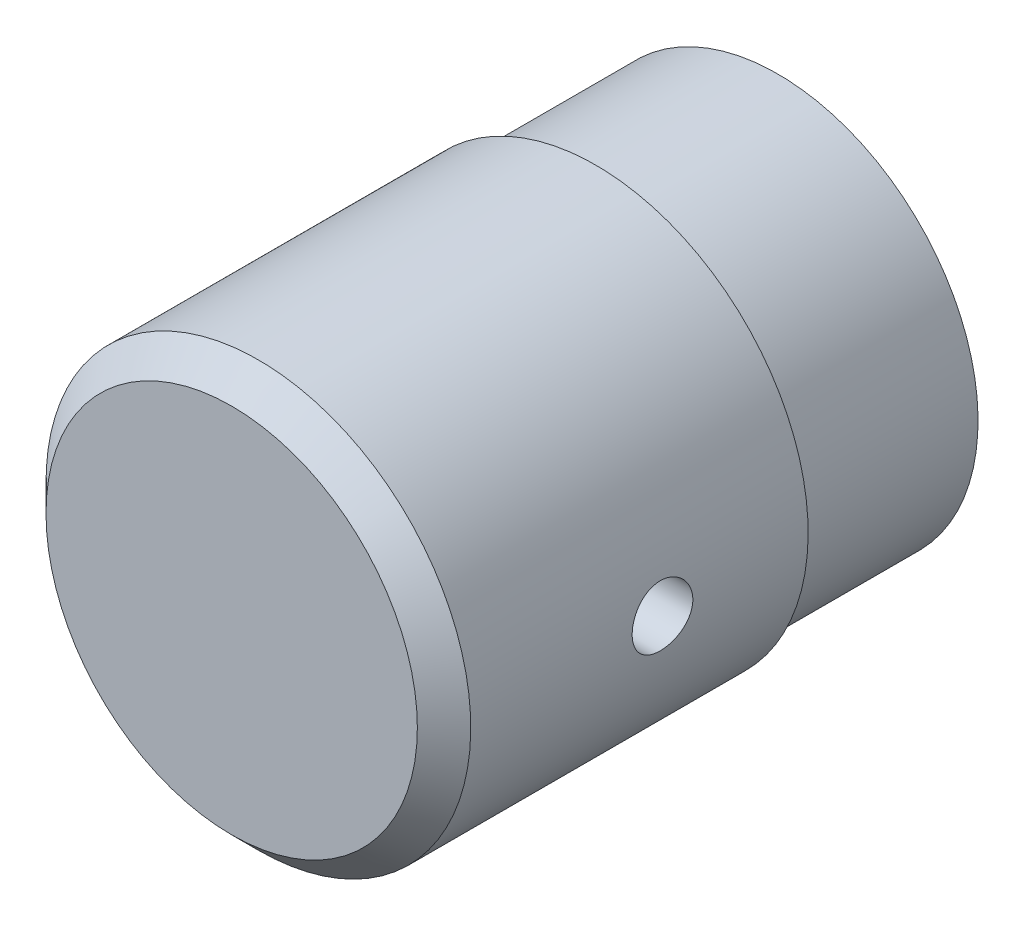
ISO-10303-21;
HEADER;
FILE_DESCRIPTION(('STEP AP214'),'2;1');
FILE_NAME('part.step','',(''),(''),'','','');
FILE_SCHEMA(('AUTOMOTIVE_DESIGN { 1 0 10303 214 1 1 1 1 }'));
ENDSEC;
DATA;
#1=APPLICATION_CONTEXT('core data for automotive mechanical design processes');
#2=APPLICATION_PROTOCOL_DEFINITION('international standard','automotive_design',2000,#1);
#3=PRODUCT_CONTEXT('',#1,'mechanical');
#4=PRODUCT('Part','Part','',(#3));
#5=PRODUCT_RELATED_PRODUCT_CATEGORY('part','',(#4));
#6=PRODUCT_DEFINITION_FORMATION('','',#4);
#7=PRODUCT_DEFINITION_CONTEXT('part definition',#1,'design');
#8=PRODUCT_DEFINITION('design','',#6,#7);
#9=PRODUCT_DEFINITION_SHAPE('','',#8);
#10=(LENGTH_UNIT() NAMED_UNIT(*) SI_UNIT(.MILLI.,.METRE.));
#11=(NAMED_UNIT(*) PLANE_ANGLE_UNIT() SI_UNIT($,.RADIAN.));
#12=(NAMED_UNIT(*) SI_UNIT($,.STERADIAN.) SOLID_ANGLE_UNIT());
#13=UNCERTAINTY_MEASURE_WITH_UNIT(LENGTH_MEASURE(1.E-05),#10,'distance_accuracy_value','');
#14=(GEOMETRIC_REPRESENTATION_CONTEXT(3) GLOBAL_UNCERTAINTY_ASSIGNED_CONTEXT((#13)) GLOBAL_UNIT_ASSIGNED_CONTEXT((#10,
#11,#12)) REPRESENTATION_CONTEXT('',''));
#15=CARTESIAN_POINT('',(0.,0.,0.));
#16=DIRECTION('',(0.,0.,1.));
#17=DIRECTION('',(1.,0.,0.));
#18=AXIS2_PLACEMENT_3D('',#15,#16,#17);
#19=CARTESIAN_POINT('',(0.,0.,-6.50916343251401));
#20=DIRECTION('',(0.,0.,-1.));
#21=DIRECTION('',(0.,-1.,0.));
#22=AXIS2_PLACEMENT_3D('',#19,#20,#21);
#23=CYLINDRICAL_SURFACE('',#22,17.5);
#24=CARTESIAN_POINT('',(0.,0.,15.));
#25=DIRECTION('',(0.,0.,-1.));
#26=DIRECTION('',(0.,-1.,0.));
#27=AXIS2_PLACEMENT_3D('',#24,#25,#26);
#28=CIRCLE('',#27,17.5);
#29=CARTESIAN_POINT('',(0.,-17.5,15.));
#30=VERTEX_POINT('',#29);
#31=EDGE_CURVE('E37',#30,#30,#28,.T.);
#32=ORIENTED_EDGE('',*,*,#31,.F.);
#33=EDGE_LOOP('',(#32));
#34=FACE_BOUND('',#33,.T.);
#35=CARTESIAN_POINT('',(0.,0.,42.8));
#36=DIRECTION('',(0.,0.,-1.));
#37=DIRECTION('',(0.,-1.,0.));
#38=AXIS2_PLACEMENT_3D('',#35,#36,#37);
#39=CIRCLE('',#38,17.5);
#40=CARTESIAN_POINT('',(0.,-17.5,42.8));
#41=VERTEX_POINT('',#40);
#42=EDGE_CURVE('E40',#41,#41,#39,.T.);
#43=ORIENTED_EDGE('',*,*,#42,.T.);
#44=EDGE_LOOP('',(#43));
#45=FACE_BOUND('',#44,.T.);
#46=CARTESIAN_POINT('',(17.3205080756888,2.5,27.));
#47=CARTESIAN_POINT('',(17.3205103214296,2.49999417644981,26.8603447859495));
#48=CARTESIAN_POINT('',(17.3222153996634,2.48825830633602,26.7206066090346));
#49=CARTESIAN_POINT('',(17.3288474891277,2.44163425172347,26.4450317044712));
#50=CARTESIAN_POINT('',(17.3337777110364,2.40672299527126,26.3091990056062));
#51=CARTESIAN_POINT('',(17.3462905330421,2.31480923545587,26.0454641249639));
#52=CARTESIAN_POINT('',(17.3538711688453,2.25782308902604,25.9175561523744));
#53=CARTESIAN_POINT('',(17.3708283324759,2.12341469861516,25.673137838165));
#54=CARTESIAN_POINT('',(17.3802045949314,2.04599547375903,25.5566258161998));
#55=CARTESIAN_POINT('',(17.3997728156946,1.87231683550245,25.3374396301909));
#56=CARTESIAN_POINT('',(17.4099696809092,1.77593820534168,25.2348603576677));
#57=CARTESIAN_POINT('',(17.4299862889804,1.567333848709,25.0472730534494));
#58=CARTESIAN_POINT('',(17.4398060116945,1.4551072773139,24.9622659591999));
#59=CARTESIAN_POINT('',(17.4580129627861,1.21738798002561,24.8118886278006));
#60=CARTESIAN_POINT('',(17.4663937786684,1.09183970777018,24.746605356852));
#61=CARTESIAN_POINT('',(17.4807243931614,0.831420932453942,24.6380865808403));
#62=CARTESIAN_POINT('',(17.4866743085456,0.696550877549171,24.594850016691));
#63=CARTESIAN_POINT('',(17.4954381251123,0.422292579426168,24.5319384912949));
#64=CARTESIAN_POINT('',(17.4982731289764,0.28294140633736,24.5121049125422));
#65=CARTESIAN_POINT('',(17.5005599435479,0.00286195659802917,24.4960701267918));
#66=CARTESIAN_POINT('',(17.5000119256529,-0.137866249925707,24.4998677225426));
#67=CARTESIAN_POINT('',(17.4956113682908,-0.415623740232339,24.5308617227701));
#68=CARTESIAN_POINT('',(17.4917829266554,-0.5526724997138,24.5578874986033));
#69=CARTESIAN_POINT('',(17.4812785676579,-0.820269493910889,24.6343031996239));
#70=CARTESIAN_POINT('',(17.4746025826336,-0.950817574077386,24.6836936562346));
#71=CARTESIAN_POINT('',(17.4591117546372,-1.20222745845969,24.8036134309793));
#72=CARTESIAN_POINT('',(17.4502896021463,-1.32305424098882,24.8742151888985));
#73=CARTESIAN_POINT('',(17.4314908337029,-1.55120977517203,25.0345006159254));
#74=CARTESIAN_POINT('',(17.4215141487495,-1.65853771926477,25.1241854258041));
#75=CARTESIAN_POINT('',(17.4014150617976,-1.85765373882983,25.3210432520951));
#76=CARTESIAN_POINT('',(17.3912921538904,-1.94929461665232,25.4283651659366));
#77=CARTESIAN_POINT('',(17.3721286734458,-2.11328736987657,25.6569431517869));
#78=CARTESIAN_POINT('',(17.3630881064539,-2.18563914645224,25.778199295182));
#79=CARTESIAN_POINT('',(17.3471131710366,-2.30901626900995,26.0313503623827));
#80=CARTESIAN_POINT('',(17.3401801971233,-2.36002750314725,26.1632522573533));
#81=CARTESIAN_POINT('',(17.3292308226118,-2.43913279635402,26.4338719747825));
#82=CARTESIAN_POINT('',(17.3252142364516,-2.46722831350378,26.5725893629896));
#83=CARTESIAN_POINT('',(17.3205872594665,-2.4995048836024,26.8515956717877));
#84=CARTESIAN_POINT('',(17.3199472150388,-2.5038941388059,26.9918600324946));
#85=CARTESIAN_POINT('',(17.3220671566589,-2.489185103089,27.2711222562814));
#86=CARTESIAN_POINT('',(17.324827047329,-2.47008747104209,27.410120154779));
#87=CARTESIAN_POINT('',(17.3334087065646,-2.40912297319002,27.6822652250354));
#88=CARTESIAN_POINT('',(17.3392166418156,-2.36735894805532,27.8154359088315));
#89=CARTESIAN_POINT('',(17.3532286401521,-2.26235382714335,28.0728859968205));
#90=CARTESIAN_POINT('',(17.3614328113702,-2.19911176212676,28.197164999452));
#91=CARTESIAN_POINT('',(17.3793831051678,-2.0524420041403,28.4342398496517));
#92=CARTESIAN_POINT('',(17.3891394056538,-1.96887900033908,28.5469512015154));
#93=CARTESIAN_POINT('',(17.409063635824,-1.7841284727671,28.7568246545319));
#94=CARTESIAN_POINT('',(17.4192315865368,-1.68294004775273,28.8539859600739));
#95=CARTESIAN_POINT('',(17.4389256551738,-1.46489635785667,29.0307440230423));
#96=CARTESIAN_POINT('',(17.4484463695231,-1.34792896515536,29.1102031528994));
#97=CARTESIAN_POINT('',(17.4656902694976,-1.10218588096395,29.2483444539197));
#98=CARTESIAN_POINT('',(17.4734135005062,-0.973410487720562,29.3070271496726));
#99=CARTESIAN_POINT('',(17.4861684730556,-0.708144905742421,29.4017276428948));
#100=CARTESIAN_POINT('',(17.4912092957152,-0.571682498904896,29.4378219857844));
#101=CARTESIAN_POINT('',(17.4980694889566,-0.294556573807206,29.4865693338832));
#102=CARTESIAN_POINT('',(17.4998890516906,-0.153893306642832,29.4992237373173));
#103=CARTESIAN_POINT('',(17.5001000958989,0.126303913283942,29.5007002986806));
#104=CARTESIAN_POINT('',(17.4985219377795,0.265836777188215,29.489733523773));
#105=CARTESIAN_POINT('',(17.4921758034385,0.541053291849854,29.4447298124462));
#106=CARTESIAN_POINT('',(17.4874078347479,0.676736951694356,29.4106929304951));
#107=CARTESIAN_POINT('',(17.4752152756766,0.940354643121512,29.3205875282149));
#108=CARTESIAN_POINT('',(17.4677922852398,1.06829328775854,29.2645322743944));
#109=CARTESIAN_POINT('',(17.4511070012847,1.31298213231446,29.1320035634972));
#110=CARTESIAN_POINT('',(17.4418446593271,1.42973203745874,29.0555295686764));
#111=CARTESIAN_POINT('',(17.4224130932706,1.6498024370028,28.8835653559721));
#112=CARTESIAN_POINT('',(17.4122368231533,1.75300020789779,28.7879188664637));
#113=CARTESIAN_POINT('',(17.3921777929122,1.94195895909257,28.5806530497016));
#114=CARTESIAN_POINT('',(17.3822951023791,2.02771583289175,28.4690299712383));
#115=CARTESIAN_POINT('',(17.3638885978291,2.17974404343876,28.2323182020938));
#116=CARTESIAN_POINT('',(17.3553719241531,2.24591442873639,28.1071641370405));
#117=CARTESIAN_POINT('',(17.3407453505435,2.35619878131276,27.8474596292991));
#118=CARTESIAN_POINT('',(17.3346329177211,2.40033597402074,27.7129192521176));
#119=CARTESIAN_POINT('',(17.326941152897,2.45511568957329,27.4814544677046));
#120=CARTESIAN_POINT('',(17.324541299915,2.47192203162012,27.3859695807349));
#121=CARTESIAN_POINT('',(17.3213239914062,2.49436614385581,27.1936697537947));
#122=CARTESIAN_POINT('',(17.3205065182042,2.50000403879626,27.096854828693));
#123=CARTESIAN_POINT('',(17.3205080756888,2.5,27.));
#124=B_SPLINE_CURVE_WITH_KNOTS('',3,(#46,#47,#48,#49,#50,#51,#52,#53,#54,#55,#56,#57,#58,#59,
#60,#61,#62,#63,#64,#65,#66,#67,#68,#69,#70,#71,#72,#73,#74,#75,#76,#77,#78,#79,#80,#81,#82,#83,
#84,#85,#86,#87,#88,#89,#90,#91,#92,#93,#94,#95,#96,#97,#98,#99,#100,#101,#102,#103,#104,#105,
#106,#107,#108,#109,#110,#111,#112,#113,#114,#115,#116,#117,#118,#119,#120,#121,#122,#123),
.UNSPECIFIED.,.T.,.F.,(4,2,2,2,2,2,2,2,2,2,2,2,2,2,2,2,2,2,2,2,2,2,2,2,2,2,2,2,2,2,2,2,2,2,2,2,
2,2,4),(0.,0.418611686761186,0.837640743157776,1.2563599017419,1.67501722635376,
2.09639644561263,2.51779813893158,2.94103163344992,3.36424479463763,3.78457277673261,
4.20487946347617,4.62212481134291,5.0393800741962,5.45807684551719,5.87679865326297,
6.29925647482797,6.72171646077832,7.14445536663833,7.56716737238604,7.9861607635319,
8.40514240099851,8.82223876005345,9.2393539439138,9.6593265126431,10.0793205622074,
10.502474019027,10.9256167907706,11.3473177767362,11.7689936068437,12.1869171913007,
12.6048397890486,13.0225109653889,13.4401931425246,13.8614293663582,14.2827646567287,
14.7062351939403,15.1292583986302,15.4195806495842,15.7098996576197),.UNSPECIFIED.);
#125=CARTESIAN_POINT('',(17.3205080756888,2.5,27.));
#126=VERTEX_POINT('',#125);
#127=EDGE_CURVE('E52',#126,#126,#124,.T.);
#128=ORIENTED_EDGE('',*,*,#127,.T.);
#129=EDGE_LOOP('',(#128));
#130=FACE_BOUND('',#129,.T.);
#131=ADVANCED_FACE('F12',(#34,#45,#130),#23,.T.);
#132=CARTESIAN_POINT('',(0.,0.,37.));
#133=DIRECTION('',(0.,0.,-1.));
#134=DIRECTION('',(0.,-1.,0.));
#135=AXIS2_PLACEMENT_3D('',#132,#133,#134);
#136=CYLINDRICAL_SURFACE('',#135,5.);
#137=CARTESIAN_POINT('',(0.,0.,15.));
#138=DIRECTION('',(0.,0.,-1.));
#139=DIRECTION('',(0.,-1.,0.));
#140=AXIS2_PLACEMENT_3D('',#137,#138,#139);
#141=CIRCLE('',#140,5.);
#142=CARTESIAN_POINT('',(0.,-5.,15.));
#143=VERTEX_POINT('',#142);
#144=EDGE_CURVE('E49',#143,#143,#141,.T.);
#145=ORIENTED_EDGE('',*,*,#144,.T.);
#146=EDGE_LOOP('',(#145));
#147=FACE_BOUND('',#146,.T.);
#148=CARTESIAN_POINT('',(0.,0.,37.));
#149=DIRECTION('',(0.,0.,-1.));
#150=DIRECTION('',(0.,-1.,0.));
#151=AXIS2_PLACEMENT_3D('',#148,#149,#150);
#152=CIRCLE('',#151,5.);
#153=CARTESIAN_POINT('',(0.,-5.,37.));
#154=VERTEX_POINT('',#153);
#155=EDGE_CURVE('E46',#154,#154,#152,.T.);
#156=ORIENTED_EDGE('',*,*,#155,.F.);
#157=EDGE_LOOP('',(#156));
#158=FACE_BOUND('',#157,.T.);
#159=CARTESIAN_POINT('',(4.33012701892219,2.5,27.));
#160=CARTESIAN_POINT('',(4.33013982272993,2.49998948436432,26.8697334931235));
#161=CARTESIAN_POINT('',(4.33609541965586,2.48974954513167,26.7392972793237));
#162=CARTESIAN_POINT('',(4.35905877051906,2.44930840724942,26.4824310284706));
#163=CARTESIAN_POINT('',(4.37608974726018,2.41906526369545,26.3560099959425));
#164=CARTESIAN_POINT('',(4.41873376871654,2.34024976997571,26.1113710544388));
#165=CARTESIAN_POINT('',(4.44430111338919,2.29177485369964,25.9931134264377));
#166=CARTESIAN_POINT('',(4.50106659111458,2.17816884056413,25.7664394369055));
#167=CARTESIAN_POINT('',(4.53226502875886,2.11303684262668,25.6580236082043));
#168=CARTESIAN_POINT('',(4.5999217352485,1.96166634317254,25.4442356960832));
#169=CARTESIAN_POINT('',(4.63660159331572,1.87413008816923,25.3398521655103));
#170=CARTESIAN_POINT('',(4.70929956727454,1.68313452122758,25.1464790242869));
#171=CARTESIAN_POINT('',(4.7453173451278,1.57966731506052,25.0574970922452));
#172=CARTESIAN_POINT('',(4.81553692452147,1.35122390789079,24.8915821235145));
#173=CARTESIAN_POINT('',(4.84945266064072,1.22526797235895,24.8158655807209));
#174=CARTESIAN_POINT('',(4.90876890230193,0.960392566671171,24.6871478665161));
#175=CARTESIAN_POINT('',(4.93417477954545,0.821481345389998,24.6341323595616));
#176=CARTESIAN_POINT('',(4.9720115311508,0.545112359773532,24.5562383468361));
#177=CARTESIAN_POINT('',(4.98523700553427,0.408254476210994,24.5296261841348));
#178=CARTESIAN_POINT('',(5.00018959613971,0.131426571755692,24.4995847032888));
#179=CARTESIAN_POINT('',(5.00192366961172,-0.00854151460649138,24.4961413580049));
#180=CARTESIAN_POINT('',(4.9940745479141,-0.274581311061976,24.5118666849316));
#181=CARTESIAN_POINT('',(4.98546239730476,-0.400802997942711,24.5290950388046));
#182=CARTESIAN_POINT('',(4.95935613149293,-0.648284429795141,24.5822021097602));
#183=CARTESIAN_POINT('',(4.94186135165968,-0.769543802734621,24.6180822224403));
#184=CARTESIAN_POINT('',(4.89928958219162,-1.00577347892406,24.7077064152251));
#185=CARTESIAN_POINT('',(4.87411103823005,-1.12063355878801,24.7616907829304));
#186=CARTESIAN_POINT('',(4.8184411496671,-1.33994200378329,24.8856585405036));
#187=CARTESIAN_POINT('',(4.78794790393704,-1.44438662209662,24.9556476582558));
#188=CARTESIAN_POINT('',(4.72110985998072,-1.65043415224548,25.1172383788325));
#189=CARTESIAN_POINT('',(4.68448439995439,-1.75083518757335,25.210257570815));
#190=CARTESIAN_POINT('',(4.61135851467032,-1.9352609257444,25.4114743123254));
#191=CARTESIAN_POINT('',(4.57485820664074,-2.01927302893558,25.519683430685));
#192=CARTESIAN_POINT('',(4.50360390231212,-2.17376333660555,25.7566204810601));
#193=CARTESIAN_POINT('',(4.46910799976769,-2.24304328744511,25.8862150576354));
#194=CARTESIAN_POINT('',(4.40938625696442,-2.35829778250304,26.1573441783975));
#195=CARTESIAN_POINT('',(4.38415075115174,-2.4042966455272,26.2988660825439));
#196=CARTESIAN_POINT('',(4.34861589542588,-2.4679505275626,26.578036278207));
#197=CARTESIAN_POINT('',(4.33729139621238,-2.48756280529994,26.7151027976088));
#198=CARTESIAN_POINT('',(4.32794798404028,-2.50379236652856,26.9910033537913));
#199=CARTESIAN_POINT('',(4.32991967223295,-2.50042589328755,27.1298360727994));
#200=CARTESIAN_POINT('',(4.34585841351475,-2.47259010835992,27.3891347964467));
#201=CARTESIAN_POINT('',(4.35848968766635,-2.4504695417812,27.5099486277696));
#202=CARTESIAN_POINT('',(4.39235053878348,-2.38924071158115,27.7459194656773));
#203=CARTESIAN_POINT('',(4.41358290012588,-2.35012694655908,27.8610746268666));
#204=CARTESIAN_POINT('',(4.46340555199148,-2.25411897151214,28.0885283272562));
#205=CARTESIAN_POINT('',(4.49229108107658,-2.1964851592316,28.2004475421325));
#206=CARTESIAN_POINT('',(4.55390298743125,-2.06571766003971,28.4136731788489));
#207=CARTESIAN_POINT('',(4.58663133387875,-1.99257601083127,28.5149741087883));
#208=CARTESIAN_POINT('',(4.65719996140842,-1.82209291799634,28.7174469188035));
#209=CARTESIAN_POINT('',(4.69516457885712,-1.72286318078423,28.8169928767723));
#210=CARTESIAN_POINT('',(4.76835587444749,-1.50851123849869,28.998530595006));
#211=CARTESIAN_POINT('',(4.80358162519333,-1.39338368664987,29.0805164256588));
#212=CARTESIAN_POINT('',(4.86853404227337,-1.1463384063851,29.2264343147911));
#213=CARTESIAN_POINT('',(4.89809104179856,-1.01405774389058,29.2898327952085));
#214=CARTESIAN_POINT('',(4.94708387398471,-0.738805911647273,29.392844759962));
#215=CARTESIAN_POINT('',(4.96652859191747,-0.595844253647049,29.4324791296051));
#216=CARTESIAN_POINT('',(4.99168770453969,-0.317449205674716,29.4834214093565));
#217=CARTESIAN_POINT('',(4.99849819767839,-0.182528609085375,29.4969946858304));
#218=CARTESIAN_POINT('',(5.00105325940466,0.087814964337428,29.5021081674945));
#219=CARTESIAN_POINT('',(4.99680170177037,0.223237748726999,29.4936560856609));
#220=CARTESIAN_POINT('',(4.97834922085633,0.481344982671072,29.4564589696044));
#221=CARTESIAN_POINT('',(4.96482236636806,0.6042808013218,29.4290878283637));
#222=CARTESIAN_POINT('',(4.92980234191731,0.843614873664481,29.3566825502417));
#223=CARTESIAN_POINT('',(4.90830802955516,0.96001218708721,29.3116458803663));
#224=CARTESIAN_POINT('',(4.85814826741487,1.18855854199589,29.2031821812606));
#225=CARTESIAN_POINT('',(4.82921542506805,1.3003129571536,29.1390509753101));
#226=CARTESIAN_POINT('',(4.76720333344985,1.51193650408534,28.9951058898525));
#227=CARTESIAN_POINT('',(4.73412218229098,1.61180014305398,28.9152848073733));
#228=CARTESIAN_POINT('',(4.66321523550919,1.80728542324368,28.7330042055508));
#229=CARTESIAN_POINT('',(4.62524489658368,1.90149582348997,28.6290822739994));
#230=CARTESIAN_POINT('',(4.55157698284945,2.07165660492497,28.4063847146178));
#231=CARTESIAN_POINT('',(4.51588143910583,2.14759083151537,28.2875960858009));
#232=CARTESIAN_POINT('',(4.44998982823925,2.28108393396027,28.0333638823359));
#233=CARTESIAN_POINT('',(4.42000320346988,2.33798627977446,27.8975126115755));
#234=CARTESIAN_POINT('',(4.38370272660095,2.40494911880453,27.6867773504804));
#235=CARTESIAN_POINT('',(4.37305486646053,2.42419582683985,27.6154402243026));
#236=CARTESIAN_POINT('',(4.35507574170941,2.45635087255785,27.4709593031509));
#237=CARTESIAN_POINT('',(4.3477421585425,2.46926364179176,27.3978168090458));
#238=CARTESIAN_POINT('',(4.33823779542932,2.48591166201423,27.2704990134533));
#239=CARTESIAN_POINT('',(4.33520487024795,2.49118864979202,27.216583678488));
#240=CARTESIAN_POINT('',(4.3311467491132,2.49823512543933,27.1084553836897));
#241=CARTESIAN_POINT('',(4.33012168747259,2.50000437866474,27.0542424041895));
#242=CARTESIAN_POINT('',(4.33012701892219,2.5,27.));
#243=B_SPLINE_CURVE_WITH_KNOTS('',3,(#159,#160,#161,#162,#163,#164,#165,#166,#167,#168,#169,
#170,#171,#172,#173,#174,#175,#176,#177,#178,#179,#180,#181,#182,#183,#184,#185,#186,#187,#188,
#189,#190,#191,#192,#193,#194,#195,#196,#197,#198,#199,#200,#201,#202,#203,#204,#205,#206,#207,
#208,#209,#210,#211,#212,#213,#214,#215,#216,#217,#218,#219,#220,#221,#222,#223,#224,#225,#226,
#227,#228,#229,#230,#231,#232,#233,#234,#235,#236,#237,#238,#239,#240,#241,#242),.UNSPECIFIED.,
.T.,.F.,(4,2,2,2,2,2,2,2,2,2,2,2,2,2,2,2,2,2,2,2,2,2,2,2,2,2,2,2,2,2,2,2,2,2,2,2,2,2,2,2,2,4),
(0.,0.390580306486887,0.781982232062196,1.17132148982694,1.56068181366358,1.98215578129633,
2.40383927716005,2.85394730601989,3.30377067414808,3.72158712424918,4.13915059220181,
4.52040243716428,4.90168281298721,5.28823836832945,5.67493248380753,6.09817978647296,
6.52175120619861,6.97222104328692,7.42221935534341,7.83655727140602,8.25060232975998,
8.61935458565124,8.98822631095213,9.37418241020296,9.76033715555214,10.1951685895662,
10.6301466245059,11.076604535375,11.5226694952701,11.927806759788,12.3328021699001,
12.7111106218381,13.0894733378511,13.4840187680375,13.8787457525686,14.3127560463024,
14.7471485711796,15.1952687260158,15.4189244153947,15.6424233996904,15.8050484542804,
15.9676843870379),.UNSPECIFIED.);
#244=CARTESIAN_POINT('',(4.33012701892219,2.5,27.));
#245=VERTEX_POINT('',#244);
#246=EDGE_CURVE('E16',#245,#245,#243,.T.);
#247=ORIENTED_EDGE('',*,*,#246,.F.);
#248=EDGE_LOOP('',(#247));
#249=FACE_BOUND('',#248,.T.);
#250=ADVANCED_FACE('F71',(#147,#158,#249),#136,.F.);
#251=CARTESIAN_POINT('',(0.,0.,45.));
#252=DIRECTION('',(0.,0.,-1.));
#253=DIRECTION('',(0.,-1.,0.));
#254=AXIS2_PLACEMENT_3D('',#251,#252,#253);
#255=PLANE('',#254);
#256=CARTESIAN_POINT('',(0.,0.,45.));
#257=DIRECTION('',(0.,0.,-1.));
#258=DIRECTION('',(0.,-1.,0.));
#259=AXIS2_PLACEMENT_3D('',#256,#257,#258);
#260=CIRCLE('',#259,15.3);
#261=CARTESIAN_POINT('',(0.,-15.3,45.));
#262=VERTEX_POINT('',#261);
#263=EDGE_CURVE('E43',#262,#262,#260,.T.);
#264=ORIENTED_EDGE('',*,*,#263,.F.);
#265=EDGE_LOOP('',(#264));
#266=FACE_BOUND('',#265,.T.);
#267=ADVANCED_FACE('F14',(#266),#255,.F.);
#268=CARTESIAN_POINT('',(0.,0.,15.));
#269=DIRECTION('',(0.,0.,-1.));
#270=DIRECTION('',(0.,-1.,0.));
#271=AXIS2_PLACEMENT_3D('',#268,#269,#270);
#272=PLANE('',#271);
#273=ORIENTED_EDGE('',*,*,#144,.F.);
#274=EDGE_LOOP('',(#273));
#275=FACE_BOUND('',#274,.T.);
#276=CARTESIAN_POINT('',(0.,0.,15.));
#277=DIRECTION('',(0.,0.,-1.));
#278=DIRECTION('',(0.,-1.,0.));
#279=AXIS2_PLACEMENT_3D('',#276,#277,#278);
#280=CIRCLE('',#279,14.);
#281=CARTESIAN_POINT('',(0.,-14.,15.));
#282=VERTEX_POINT('',#281);
#283=EDGE_CURVE('E8',#282,#282,#280,.T.);
#284=ORIENTED_EDGE('',*,*,#283,.T.);
#285=EDGE_LOOP('',(#284));
#286=FACE_BOUND('',#285,.T.);
#287=ADVANCED_FACE('F116',(#275,#286),#272,.T.);
#288=CARTESIAN_POINT('',(0.,0.,-6.50916343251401));
#289=DIRECTION('',(0.,0.,-1.));
#290=DIRECTION('',(0.,-1.,0.));
#291=AXIS2_PLACEMENT_3D('',#288,#289,#290);
#292=CYLINDRICAL_SURFACE('',#291,14.);
#293=ORIENTED_EDGE('',*,*,#283,.F.);
#294=EDGE_LOOP('',(#293));
#295=FACE_BOUND('',#294,.T.);
#296=CARTESIAN_POINT('',(0.,0.,0.));
#297=DIRECTION('',(0.,0.,-1.));
#298=DIRECTION('',(0.,-1.,0.));
#299=AXIS2_PLACEMENT_3D('',#296,#297,#298);
#300=CIRCLE('',#299,14.);
#301=CARTESIAN_POINT('',(0.,-14.,0.));
#302=VERTEX_POINT('',#301);
#303=EDGE_CURVE('E25',#302,#302,#300,.T.);
#304=ORIENTED_EDGE('',*,*,#303,.T.);
#305=EDGE_LOOP('',(#304));
#306=FACE_BOUND('',#305,.T.);
#307=ADVANCED_FACE('F111',(#295,#306),#292,.F.);
#308=CARTESIAN_POINT('',(14.,0.,0.));
#309=DIRECTION('',(0.,0.,-1.));
#310=DIRECTION('',(0.,-1.,0.));
#311=AXIS2_PLACEMENT_3D('',#308,#309,#310);
#312=PLANE('',#311);
#313=CARTESIAN_POINT('',(0.,0.,0.));
#314=DIRECTION('',(0.,0.,-1.));
#315=DIRECTION('',(0.,-1.,0.));
#316=AXIS2_PLACEMENT_3D('',#313,#314,#315);
#317=CIRCLE('',#316,16.5);
#318=CARTESIAN_POINT('',(0.,-16.5,0.));
#319=VERTEX_POINT('',#318);
#320=EDGE_CURVE('E29',#319,#319,#317,.T.);
#321=ORIENTED_EDGE('',*,*,#320,.T.);
#322=EDGE_LOOP('',(#321));
#323=FACE_BOUND('',#322,.T.);
#324=ORIENTED_EDGE('',*,*,#303,.F.);
#325=EDGE_LOOP('',(#324));
#326=FACE_BOUND('',#325,.T.);
#327=ADVANCED_FACE('F105',(#323,#326),#312,.T.);
#328=CARTESIAN_POINT('',(0.,0.,-6.50916343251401));
#329=DIRECTION('',(0.,0.,-1.));
#330=DIRECTION('',(0.,-1.,0.));
#331=AXIS2_PLACEMENT_3D('',#328,#329,#330);
#332=CYLINDRICAL_SURFACE('',#331,16.5);
#333=CARTESIAN_POINT('',(0.,0.,15.));
#334=DIRECTION('',(0.,0.,-1.));
#335=DIRECTION('',(0.,-1.,0.));
#336=AXIS2_PLACEMENT_3D('',#333,#334,#335);
#337=CIRCLE('',#336,16.5);
#338=CARTESIAN_POINT('',(0.,-16.5,15.));
#339=VERTEX_POINT('',#338);
#340=EDGE_CURVE('E34',#339,#339,#337,.T.);
#341=ORIENTED_EDGE('',*,*,#340,.T.);
#342=EDGE_LOOP('',(#341));
#343=FACE_BOUND('',#342,.T.);
#344=ORIENTED_EDGE('',*,*,#320,.F.);
#345=EDGE_LOOP('',(#344));
#346=FACE_BOUND('',#345,.T.);
#347=ADVANCED_FACE('F83',(#343,#346),#332,.T.);
#348=CARTESIAN_POINT('',(16.5,0.,15.));
#349=DIRECTION('',(0.,0.,-1.));
#350=DIRECTION('',(0.,-1.,0.));
#351=AXIS2_PLACEMENT_3D('',#348,#349,#350);
#352=PLANE('',#351);
#353=ORIENTED_EDGE('',*,*,#31,.T.);
#354=EDGE_LOOP('',(#353));
#355=FACE_BOUND('',#354,.T.);
#356=ORIENTED_EDGE('',*,*,#340,.F.);
#357=EDGE_LOOP('',(#356));
#358=FACE_BOUND('',#357,.T.);
#359=ADVANCED_FACE('F76',(#355,#358),#352,.T.);
#360=CARTESIAN_POINT('',(0.,0.,45.));
#361=DIRECTION('',(0.,0.,-1.));
#362=DIRECTION('',(0.,-1.,0.));
#363=AXIS2_PLACEMENT_3D('',#360,#361,#362);
#364=CONICAL_SURFACE('',#363,15.3,0.785398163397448);
#365=ORIENTED_EDGE('',*,*,#42,.F.);
#366=EDGE_LOOP('',(#365));
#367=FACE_BOUND('',#366,.T.);
#368=ORIENTED_EDGE('',*,*,#263,.T.);
#369=EDGE_LOOP('',(#368));
#370=FACE_BOUND('',#369,.T.);
#371=ADVANCED_FACE('F69',(#367,#370),#364,.T.);
#372=CARTESIAN_POINT('',(0.,0.,37.));
#373=DIRECTION('',(0.,0.,-1.));
#374=DIRECTION('',(0.,-1.,0.));
#375=AXIS2_PLACEMENT_3D('',#372,#373,#374);
#376=PLANE('',#375);
#377=ORIENTED_EDGE('',*,*,#155,.T.);
#378=EDGE_LOOP('',(#377));
#379=FACE_BOUND('',#378,.T.);
#380=ADVANCED_FACE('F65',(#379),#376,.T.);
#381=CARTESIAN_POINT('',(2.,0.,27.));
#382=DIRECTION('',(1.,0.,0.));
#383=DIRECTION('',(0.,1.,0.));
#384=AXIS2_PLACEMENT_3D('',#381,#382,#383);
#385=CYLINDRICAL_SURFACE('',#384,2.5);
#386=ORIENTED_EDGE('',*,*,#127,.F.);
#387=EDGE_LOOP('',(#386));
#388=FACE_BOUND('',#387,.T.);
#389=ORIENTED_EDGE('',*,*,#246,.T.);
#390=EDGE_LOOP('',(#389));
#391=FACE_BOUND('',#390,.T.);
#392=ADVANCED_FACE('F61',(#388,#391),#385,.F.);
#393=CLOSED_SHELL('',(#131,#250,#267,#287,#307,#327,#347,#359,#371,#380,#392));
#394=MANIFOLD_SOLID_BREP('B1',#393);
#395=ADVANCED_BREP_SHAPE_REPRESENTATION('',(#18,#394),#14);
#396=SHAPE_DEFINITION_REPRESENTATION(#9,#395);
ENDSEC;
END-ISO-10303-21;
